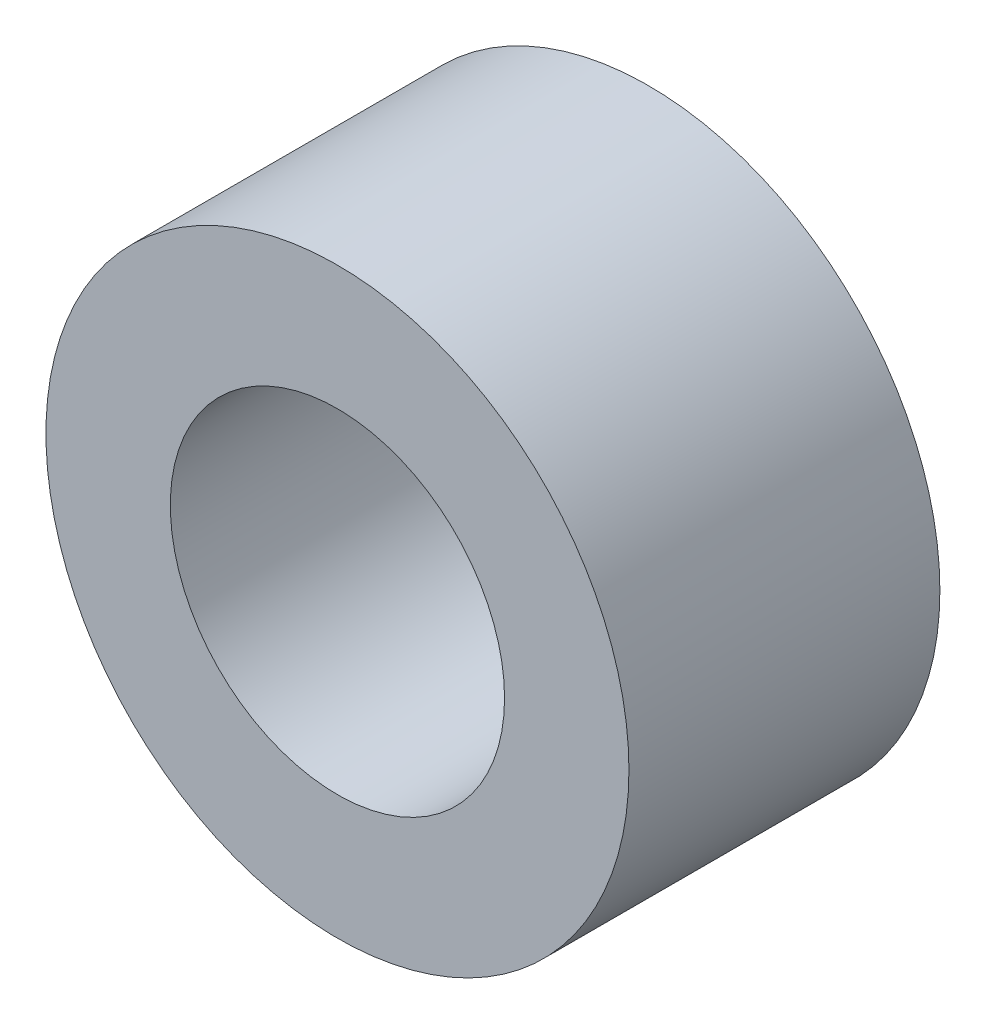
ISO-10303-21;
HEADER;
FILE_DESCRIPTION(('STEP AP214'),'2;1');
FILE_NAME('part.step','',(''),(''),'','','');
FILE_SCHEMA(('AUTOMOTIVE_DESIGN { 1 0 10303 214 1 1 1 1 }'));
ENDSEC;
DATA;
#1=APPLICATION_CONTEXT('core data for automotive mechanical design processes');
#2=APPLICATION_PROTOCOL_DEFINITION('international standard','automotive_design',2000,#1);
#3=PRODUCT_CONTEXT('',#1,'mechanical');
#4=PRODUCT('Part','Part','',(#3));
#5=PRODUCT_RELATED_PRODUCT_CATEGORY('part','',(#4));
#6=PRODUCT_DEFINITION_FORMATION('','',#4);
#7=PRODUCT_DEFINITION_CONTEXT('part definition',#1,'design');
#8=PRODUCT_DEFINITION('design','',#6,#7);
#9=PRODUCT_DEFINITION_SHAPE('','',#8);
#10=(LENGTH_UNIT() NAMED_UNIT(*) SI_UNIT(.MILLI.,.METRE.));
#11=(NAMED_UNIT(*) PLANE_ANGLE_UNIT() SI_UNIT($,.RADIAN.));
#12=(NAMED_UNIT(*) SI_UNIT($,.STERADIAN.) SOLID_ANGLE_UNIT());
#13=UNCERTAINTY_MEASURE_WITH_UNIT(LENGTH_MEASURE(1.E-05),#10,'distance_accuracy_value','');
#14=(GEOMETRIC_REPRESENTATION_CONTEXT(3) GLOBAL_UNCERTAINTY_ASSIGNED_CONTEXT((#13)) GLOBAL_UNIT_ASSIGNED_CONTEXT((#10,
#11,#12)) REPRESENTATION_CONTEXT('',''));
#15=CARTESIAN_POINT('',(0.,0.,0.));
#16=DIRECTION('',(0.,0.,1.));
#17=DIRECTION('',(1.,0.,0.));
#18=AXIS2_PLACEMENT_3D('',#15,#16,#17);
#19=CARTESIAN_POINT('',(0.,0.,20.));
#20=DIRECTION('',(0.,0.,-1.));
#21=DIRECTION('',(-1.,0.,0.));
#22=AXIS2_PLACEMENT_3D('',#19,#20,#21);
#23=CYLINDRICAL_SURFACE('',#22,21.5);
#24=CARTESIAN_POINT('',(0.,0.,20.));
#25=DIRECTION('',(0.,0.,1.));
#26=DIRECTION('',(1.,0.,0.));
#27=AXIS2_PLACEMENT_3D('',#24,#25,#26);
#28=CIRCLE('',#27,21.5);
#29=CARTESIAN_POINT('',(21.5,0.,20.));
#30=VERTEX_POINT('',#29);
#31=EDGE_CURVE('E39',#30,#30,#28,.T.);
#32=ORIENTED_EDGE('',*,*,#31,.T.);
#33=EDGE_LOOP('',(#32));
#34=FACE_BOUND('',#33,.T.);
#35=CARTESIAN_POINT('',(0.,0.,-20.));
#36=DIRECTION('',(0.,0.,1.));
#37=DIRECTION('',(1.,0.,0.));
#38=AXIS2_PLACEMENT_3D('',#35,#36,#37);
#39=CIRCLE('',#38,21.5);
#40=CARTESIAN_POINT('',(21.5,0.,-20.));
#41=VERTEX_POINT('',#40);
#42=EDGE_CURVE('E45',#41,#41,#39,.T.);
#43=ORIENTED_EDGE('',*,*,#42,.F.);
#44=EDGE_LOOP('',(#43));
#45=FACE_BOUND('',#44,.T.);
#46=ADVANCED_FACE('F32',(#34,#45),#23,.F.);
#47=CARTESIAN_POINT('',(0.,0.,20.));
#48=DIRECTION('',(0.,0.,-1.));
#49=DIRECTION('',(-1.,0.,0.));
#50=AXIS2_PLACEMENT_3D('',#47,#48,#49);
#51=CYLINDRICAL_SURFACE('',#50,37.5);
#52=CARTESIAN_POINT('',(0.,0.,20.));
#53=DIRECTION('',(0.,0.,1.));
#54=DIRECTION('',(1.,0.,0.));
#55=AXIS2_PLACEMENT_3D('',#52,#53,#54);
#56=CIRCLE('',#55,37.5);
#57=CARTESIAN_POINT('',(37.5,0.,20.));
#58=VERTEX_POINT('',#57);
#59=EDGE_CURVE('E10',#58,#58,#56,.T.);
#60=ORIENTED_EDGE('',*,*,#59,.F.);
#61=EDGE_LOOP('',(#60));
#62=FACE_BOUND('',#61,.T.);
#63=CARTESIAN_POINT('',(0.,0.,-20.));
#64=DIRECTION('',(0.,0.,1.));
#65=DIRECTION('',(1.,0.,0.));
#66=AXIS2_PLACEMENT_3D('',#63,#64,#65);
#67=CIRCLE('',#66,37.5);
#68=CARTESIAN_POINT('',(37.5,0.,-20.));
#69=VERTEX_POINT('',#68);
#70=EDGE_CURVE('E35',#69,#69,#67,.T.);
#71=ORIENTED_EDGE('',*,*,#70,.T.);
#72=EDGE_LOOP('',(#71));
#73=FACE_BOUND('',#72,.T.);
#74=ADVANCED_FACE('F52',(#62,#73),#51,.T.);
#75=CARTESIAN_POINT('',(39.814411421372,-134.546399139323,20.));
#76=DIRECTION('',(0.,0.,1.));
#77=DIRECTION('',(1.,0.,0.));
#78=AXIS2_PLACEMENT_3D('',#75,#76,#77);
#79=PLANE('',#78);
#80=ORIENTED_EDGE('',*,*,#31,.F.);
#81=EDGE_LOOP('',(#80));
#82=FACE_BOUND('',#81,.T.);
#83=ORIENTED_EDGE('',*,*,#59,.T.);
#84=EDGE_LOOP('',(#83));
#85=FACE_BOUND('',#84,.T.);
#86=ADVANCED_FACE('F56',(#82,#85),#79,.T.);
#87=CARTESIAN_POINT('',(39.814411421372,-134.546399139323,-20.));
#88=DIRECTION('',(0.,0.,1.));
#89=DIRECTION('',(1.,0.,0.));
#90=AXIS2_PLACEMENT_3D('',#87,#88,#89);
#91=PLANE('',#90);
#92=ORIENTED_EDGE('',*,*,#42,.T.);
#93=EDGE_LOOP('',(#92));
#94=FACE_BOUND('',#93,.T.);
#95=ORIENTED_EDGE('',*,*,#70,.F.);
#96=EDGE_LOOP('',(#95));
#97=FACE_BOUND('',#96,.T.);
#98=ADVANCED_FACE('F54',(#94,#97),#91,.F.);
#99=CLOSED_SHELL('',(#46,#74,#86,#98));
#100=MANIFOLD_SOLID_BREP('B2',#99);
#101=ADVANCED_BREP_SHAPE_REPRESENTATION('',(#18,#100),#14);
#102=SHAPE_DEFINITION_REPRESENTATION(#9,#101);
ENDSEC;
END-ISO-10303-21;
